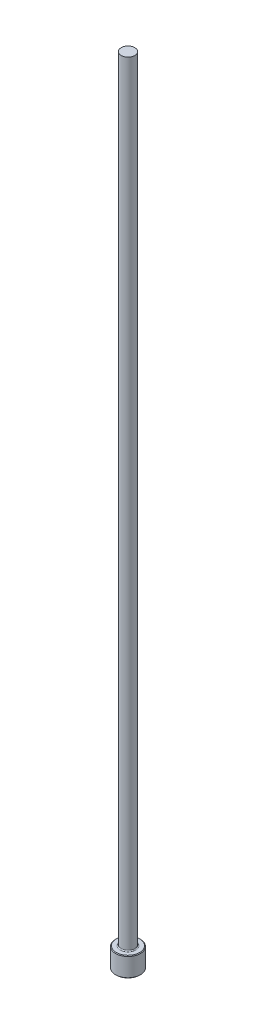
ISO-10303-21;
HEADER;
FILE_DESCRIPTION(('STEP AP214'),'2;1');
FILE_NAME('part.step','',(''),(''),'','','');
FILE_SCHEMA(('AUTOMOTIVE_DESIGN { 1 0 10303 214 1 1 1 1 }'));
ENDSEC;
DATA;
#1=APPLICATION_CONTEXT('core data for automotive mechanical design processes');
#2=APPLICATION_PROTOCOL_DEFINITION('international standard','automotive_design',2000,#1);
#3=PRODUCT_CONTEXT('',#1,'mechanical');
#4=PRODUCT('Part','Part','',(#3));
#5=PRODUCT_RELATED_PRODUCT_CATEGORY('part','',(#4));
#6=PRODUCT_DEFINITION_FORMATION('','',#4);
#7=PRODUCT_DEFINITION_CONTEXT('part definition',#1,'design');
#8=PRODUCT_DEFINITION('design','',#6,#7);
#9=PRODUCT_DEFINITION_SHAPE('','',#8);
#10=(LENGTH_UNIT() NAMED_UNIT(*) SI_UNIT(.MILLI.,.METRE.));
#11=(NAMED_UNIT(*) PLANE_ANGLE_UNIT() SI_UNIT($,.RADIAN.));
#12=(NAMED_UNIT(*) SI_UNIT($,.STERADIAN.) SOLID_ANGLE_UNIT());
#13=UNCERTAINTY_MEASURE_WITH_UNIT(LENGTH_MEASURE(1.E-05),#10,'distance_accuracy_value','');
#14=(GEOMETRIC_REPRESENTATION_CONTEXT(3) GLOBAL_UNCERTAINTY_ASSIGNED_CONTEXT((#13)) GLOBAL_UNIT_ASSIGNED_CONTEXT((#10,
#11,#12)) REPRESENTATION_CONTEXT('',''));
#15=CARTESIAN_POINT('',(0.,0.,0.));
#16=DIRECTION('',(0.,0.,1.));
#17=DIRECTION('',(1.,0.,0.));
#18=AXIS2_PLACEMENT_3D('',#15,#16,#17);
#19=CARTESIAN_POINT('',(0.,0.,0.));
#20=DIRECTION('',(0.,-1.,0.));
#21=DIRECTION('',(0.,0.,-1.));
#22=AXIS2_PLACEMENT_3D('',#19,#20,#21);
#23=PLANE('',#22);
#24=CARTESIAN_POINT('',(0.,0.,0.));
#25=DIRECTION('',(0.,-1.,0.));
#26=DIRECTION('',(0.,0.,-1.));
#27=AXIS2_PLACEMENT_3D('',#24,#25,#26);
#28=CIRCLE('',#27,0.939799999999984);
#29=CARTESIAN_POINT('',(0.,0.,0.939799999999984));
#30=VERTEX_POINT('',#29);
#31=EDGE_CURVE('E46',#30,#30,#28,.T.);
#32=ORIENTED_EDGE('',*,*,#31,.T.);
#33=EDGE_LOOP('',(#32));
#34=FACE_BOUND('',#33,.T.);
#35=ADVANCED_FACE('F35',(#34),#23,.T.);
#36=CARTESIAN_POINT('',(0.,259.958771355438,0.));
#37=DIRECTION('',(0.,1.,0.));
#38=DIRECTION('',(0.,0.,1.));
#39=AXIS2_PLACEMENT_3D('',#36,#37,#38);
#40=CYLINDRICAL_SURFACE('',#39,0.990599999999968);
#41=CARTESIAN_POINT('',(0.,1.52399999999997,0.));
#42=DIRECTION('',(0.,1.,0.));
#43=DIRECTION('',(0.,0.,1.));
#44=AXIS2_PLACEMENT_3D('',#41,#42,#43);
#45=CIRCLE('',#44,0.990599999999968);
#46=CARTESIAN_POINT('',(0.,1.52399999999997,0.990599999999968));
#47=VERTEX_POINT('',#46);
#48=EDGE_CURVE('E50',#47,#47,#45,.F.);
#49=ORIENTED_EDGE('',*,*,#48,.T.);
#50=EDGE_LOOP('',(#49));
#51=FACE_BOUND('',#50,.T.);
#52=CARTESIAN_POINT('',(0.,0.050799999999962,0.));
#53=DIRECTION('',(0.,-1.,0.));
#54=DIRECTION('',(0.,0.,-1.));
#55=AXIS2_PLACEMENT_3D('',#52,#53,#54);
#56=CIRCLE('',#55,0.990599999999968);
#57=CARTESIAN_POINT('',(0.,0.050799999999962,0.990599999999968));
#58=VERTEX_POINT('',#57);
#59=EDGE_CURVE('E55',#58,#58,#56,.F.);
#60=ORIENTED_EDGE('',*,*,#59,.T.);
#61=EDGE_LOOP('',(#60));
#62=FACE_BOUND('',#61,.T.);
#63=ADVANCED_FACE('F77',(#51,#62),#40,.T.);
#64=CARTESIAN_POINT('',(-0.990599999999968,1.5748,0.));
#65=DIRECTION('',(0.,1.,0.));
#66=DIRECTION('',(0.,0.,1.));
#67=AXIS2_PLACEMENT_3D('',#64,#65,#66);
#68=PLANE('',#67);
#69=CARTESIAN_POINT('',(0.,1.5748,0.));
#70=DIRECTION('',(0.,1.,0.));
#71=DIRECTION('',(0.,0.,1.));
#72=AXIS2_PLACEMENT_3D('',#69,#70,#71);
#73=CIRCLE('',#72,0.622299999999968);
#74=CARTESIAN_POINT('',(0.,1.5748,0.622299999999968));
#75=VERTEX_POINT('',#74);
#76=EDGE_CURVE('E10',#75,#75,#73,.F.);
#77=ORIENTED_EDGE('',*,*,#76,.T.);
#78=EDGE_LOOP('',(#77));
#79=FACE_BOUND('',#78,.T.);
#80=CARTESIAN_POINT('',(0.,1.5748,0.));
#81=DIRECTION('',(0.,1.,0.));
#82=DIRECTION('',(0.,0.,1.));
#83=AXIS2_PLACEMENT_3D('',#80,#81,#82);
#84=CIRCLE('',#83,0.939799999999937);
#85=CARTESIAN_POINT('',(0.,1.5748,0.939799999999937));
#86=VERTEX_POINT('',#85);
#87=EDGE_CURVE('E58',#86,#86,#84,.T.);
#88=ORIENTED_EDGE('',*,*,#87,.T.);
#89=EDGE_LOOP('',(#88));
#90=FACE_BOUND('',#89,.T.);
#91=ADVANCED_FACE('F69',(#79,#90),#68,.T.);
#92=CARTESIAN_POINT('',(0.,259.958771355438,0.));
#93=DIRECTION('',(0.,1.,0.));
#94=DIRECTION('',(0.,0.,1.));
#95=AXIS2_PLACEMENT_3D('',#92,#93,#94);
#96=CYLINDRICAL_SURFACE('',#95,0.546099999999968);
#97=CARTESIAN_POINT('',(0.,1.65100000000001,0.));
#98=DIRECTION('',(0.,1.,0.));
#99=DIRECTION('',(0.,0.,1.));
#100=AXIS2_PLACEMENT_3D('',#97,#98,#99);
#101=CIRCLE('',#100,0.546099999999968);
#102=CARTESIAN_POINT('',(0.,1.65100000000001,0.546099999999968));
#103=VERTEX_POINT('',#102);
#104=EDGE_CURVE('E42',#103,#103,#101,.T.);
#105=ORIENTED_EDGE('',*,*,#104,.T.);
#106=EDGE_LOOP('',(#105));
#107=FACE_BOUND('',#106,.T.);
#108=CARTESIAN_POINT('',(0.,63.5,0.));
#109=DIRECTION('',(0.,1.,0.));
#110=DIRECTION('',(0.,0.,1.));
#111=AXIS2_PLACEMENT_3D('',#108,#109,#110);
#112=CIRCLE('',#111,0.546099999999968);
#113=CARTESIAN_POINT('',(0.,63.5,0.546099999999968));
#114=VERTEX_POINT('',#113);
#115=EDGE_CURVE('E61',#114,#114,#112,.T.);
#116=ORIENTED_EDGE('',*,*,#115,.F.);
#117=EDGE_LOOP('',(#116));
#118=FACE_BOUND('',#117,.T.);
#119=ADVANCED_FACE('F67',(#107,#118),#96,.T.);
#120=CARTESIAN_POINT('',(-0.546099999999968,63.5,0.));
#121=DIRECTION('',(0.,1.,0.));
#122=DIRECTION('',(0.,0.,1.));
#123=AXIS2_PLACEMENT_3D('',#120,#121,#122);
#124=PLANE('',#123);
#125=ORIENTED_EDGE('',*,*,#115,.T.);
#126=EDGE_LOOP('',(#125));
#127=FACE_BOUND('',#126,.T.);
#128=ADVANCED_FACE('F65',(#127),#124,.T.);
#129=CARTESIAN_POINT('',(0.,1.57479999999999,0.));
#130=DIRECTION('',(0.,-1.,0.));
#131=DIRECTION('',(0.,0.,-1.));
#132=AXIS2_PLACEMENT_3D('',#129,#130,#131);
#133=CONICAL_SURFACE('',#132,0.939799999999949,0.785398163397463);
#134=ORIENTED_EDGE('',*,*,#48,.F.);
#135=EDGE_LOOP('',(#134));
#136=FACE_BOUND('',#135,.T.);
#137=ORIENTED_EDGE('',*,*,#87,.F.);
#138=EDGE_LOOP('',(#137));
#139=FACE_BOUND('',#138,.T.);
#140=ADVANCED_FACE('F75',(#136,#139),#133,.T.);
#141=CARTESIAN_POINT('',(0.,0.050799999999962,0.));
#142=DIRECTION('',(0.,1.,0.));
#143=DIRECTION('',(0.,0.,1.));
#144=AXIS2_PLACEMENT_3D('',#141,#142,#143);
#145=CONICAL_SURFACE('',#144,0.990599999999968,0.785398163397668);
#146=CARTESIAN_POINT('',(0.,0.,0.939799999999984));
#147=CARTESIAN_POINT('',(0.,0.000529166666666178,0.94032916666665));
#148=CARTESIAN_POINT('',(0.,0.00105833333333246,0.940858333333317));
#149=CARTESIAN_POINT('',(0.,0.00211666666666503,0.94191666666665));
#150=CARTESIAN_POINT('',(0.,0.00264583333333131,0.942445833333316));
#151=CARTESIAN_POINT('',(0.,0.00370416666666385,0.943504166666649));
#152=CARTESIAN_POINT('',(0.,0.0042333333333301,0.944033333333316));
#153=CARTESIAN_POINT('',(0.,0.00529166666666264,0.945091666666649));
#154=CARTESIAN_POINT('',(0.,0.00582083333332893,0.945620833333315));
#155=CARTESIAN_POINT('',(0.,0.00687916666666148,0.946679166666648));
#156=CARTESIAN_POINT('',(0.,0.00740833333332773,0.947208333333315));
#157=CARTESIAN_POINT('',(0.,0.00846666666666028,0.948266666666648));
#158=CARTESIAN_POINT('',(0.,0.00899583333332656,0.948795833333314));
#159=CARTESIAN_POINT('',(0.,0.0100541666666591,0.949854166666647));
#160=CARTESIAN_POINT('',(0.,0.0105833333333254,0.950383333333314));
#161=CARTESIAN_POINT('',(0.,0.0116416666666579,0.951441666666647));
#162=CARTESIAN_POINT('',(0.,0.0121708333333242,0.951970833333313));
#163=CARTESIAN_POINT('',(0.,0.0132291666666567,0.953029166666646));
#164=CARTESIAN_POINT('',(0.,0.013758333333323,0.953558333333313));
#165=CARTESIAN_POINT('',(0.,0.0148166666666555,0.954616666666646));
#166=CARTESIAN_POINT('',(0.,0.0153458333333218,0.955145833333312));
#167=CARTESIAN_POINT('',(0.,0.0164041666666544,0.956204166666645));
#168=CARTESIAN_POINT('',(0.,0.0169333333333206,0.956733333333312));
#169=CARTESIAN_POINT('',(0.,0.0179916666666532,0.957791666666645));
#170=CARTESIAN_POINT('',(0.,0.0185208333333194,0.958320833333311));
#171=CARTESIAN_POINT('',(0.,0.019579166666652,0.959379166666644));
#172=CARTESIAN_POINT('',(0.,0.0201083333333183,0.959908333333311));
#173=CARTESIAN_POINT('',(0.,0.0211666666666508,0.960966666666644));
#174=CARTESIAN_POINT('',(0.,0.0216958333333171,0.96149583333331));
#175=CARTESIAN_POINT('',(0.,0.0227541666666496,0.962554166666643));
#176=CARTESIAN_POINT('',(0.,0.0232833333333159,0.96308333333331));
#177=CARTESIAN_POINT('',(0.,0.0243416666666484,0.964141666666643));
#178=CARTESIAN_POINT('',(0.,0.0248708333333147,0.964670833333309));
#179=CARTESIAN_POINT('',(0.,0.0259291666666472,0.965729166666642));
#180=CARTESIAN_POINT('',(0.,0.0264583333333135,0.966258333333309));
#181=CARTESIAN_POINT('',(0.,0.0275166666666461,0.967316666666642));
#182=CARTESIAN_POINT('',(0.,0.0280458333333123,0.967845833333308));
#183=CARTESIAN_POINT('',(0.,0.0291041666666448,0.968904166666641));
#184=CARTESIAN_POINT('',(0.,0.0296333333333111,0.969433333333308));
#185=CARTESIAN_POINT('',(0.,0.0306916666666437,0.970491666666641));
#186=CARTESIAN_POINT('',(0.,0.03122083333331,0.971020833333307));
#187=CARTESIAN_POINT('',(0.,0.0322791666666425,0.97207916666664));
#188=CARTESIAN_POINT('',(0.,0.0328083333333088,0.972608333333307));
#189=CARTESIAN_POINT('',(0.,0.0338666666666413,0.97366666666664));
#190=CARTESIAN_POINT('',(0.,0.0343958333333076,0.974195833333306));
#191=CARTESIAN_POINT('',(0.,0.0354541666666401,0.975254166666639));
#192=CARTESIAN_POINT('',(0.,0.0359833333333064,0.975783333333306));
#193=CARTESIAN_POINT('',(0.,0.0370416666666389,0.976841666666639));
#194=CARTESIAN_POINT('',(0.,0.0375708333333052,0.977370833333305));
#195=CARTESIAN_POINT('',(0.,0.0386291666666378,0.978429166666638));
#196=CARTESIAN_POINT('',(0.,0.039158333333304,0.978958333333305));
#197=CARTESIAN_POINT('',(0.,0.0402166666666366,0.980016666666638));
#198=CARTESIAN_POINT('',(0.,0.0407458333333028,0.980545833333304));
#199=CARTESIAN_POINT('',(0.,0.0418041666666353,0.981604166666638));
#200=CARTESIAN_POINT('',(0.,0.0423333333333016,0.982133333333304));
#201=CARTESIAN_POINT('',(0.,0.0433916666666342,0.983191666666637));
#202=CARTESIAN_POINT('',(0.,0.0439208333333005,0.983720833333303));
#203=CARTESIAN_POINT('',(0.,0.044979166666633,0.984779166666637));
#204=CARTESIAN_POINT('',(0.,0.0455083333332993,0.985308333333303));
#205=CARTESIAN_POINT('',(0.,0.0465666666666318,0.986366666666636));
#206=CARTESIAN_POINT('',(0.,0.0470958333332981,0.986895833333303));
#207=CARTESIAN_POINT('',(0.,0.0481541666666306,0.987954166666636));
#208=CARTESIAN_POINT('',(0.,0.0486833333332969,0.988483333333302));
#209=CARTESIAN_POINT('',(0.,0.0497416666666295,0.989541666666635));
#210=CARTESIAN_POINT('',(0.,0.0502708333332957,0.990070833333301));
#211=CARTESIAN_POINT('',(0.,0.050799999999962,0.990599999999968));
#212=B_SPLINE_CURVE_WITH_KNOTS('',3,(#146,#147,#148,#149,#150,#151,#152,#153,#154,#155,#156,
#157,#158,#159,#160,#161,#162,#163,#164,#165,#166,#167,#168,#169,#170,#171,#172,#173,#174,#175,
#176,#177,#178,#179,#180,#181,#182,#183,#184,#185,#186,#187,#188,#189,#190,#191,#192,#193,#194,
#195,#196,#197,#198,#199,#200,#201,#202,#203,#204,#205,#206,#207,#208,#209,#210,#211),
.UNSPECIFIED.,.F.,.F.,(4,2,2,2,2,2,2,2,2,2,2,2,2,2,2,2,2,2,2,2,2,2,2,2,2,2,2,2,2,2,2,2,4),(0.,
0.00224506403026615,0.00449012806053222,0.00673519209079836,0.00898025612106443,
0.0112253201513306,0.0134703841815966,0.0157154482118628,0.0179605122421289,0.020205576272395,
0.0224506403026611,0.0246957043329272,0.0269407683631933,0.0291858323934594,0.0314308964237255,
0.0336759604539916,0.0359210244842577,0.0381660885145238,0.0404111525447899,0.042656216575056,
0.0449012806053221,0.0471463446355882,0.0493914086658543,0.0516364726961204,0.0538815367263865,
0.0561266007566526,0.0583716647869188,0.0606167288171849,0.0628617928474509,0.065106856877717,
0.0673519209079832,0.0695969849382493,0.0718420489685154),.UNSPECIFIED.);
#213=EDGE_CURVE('BSEAM89',#30,#58,#212,.T.);
#214=ORIENTED_EDGE('',*,*,#31,.F.);
#215=ORIENTED_EDGE('',*,*,#59,.F.);
#216=ORIENTED_EDGE('',*,*,#213,.T.);
#217=ORIENTED_EDGE('',*,*,#213,.F.);
#218=EDGE_LOOP('',(#214,#216,#215,#217));
#219=FACE_BOUND('',#218,.T.);
#220=ADVANCED_FACE('F89',(#219),#145,.T.);
#221=CARTESIAN_POINT('',(0.,1.65100000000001,0.));
#222=DIRECTION('',(0.,1.,0.));
#223=DIRECTION('',(0.,0.,1.));
#224=AXIS2_PLACEMENT_3D('',#221,#222,#223);
#225=TOROIDAL_SURFACE('',#224,0.622299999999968,0.0762);
#226=ORIENTED_EDGE('',*,*,#76,.F.);
#227=EDGE_LOOP('',(#226));
#228=FACE_BOUND('',#227,.T.);
#229=ORIENTED_EDGE('',*,*,#104,.F.);
#230=EDGE_LOOP('',(#229));
#231=FACE_BOUND('',#230,.T.);
#232=ADVANCED_FACE('F37',(#228,#231),#225,.F.);
#233=CLOSED_SHELL('',(#35,#63,#91,#119,#128,#140,#220,#232));
#234=MANIFOLD_SOLID_BREP('B2',#233);
#235=ADVANCED_BREP_SHAPE_REPRESENTATION('',(#18,#234),#14);
#236=SHAPE_DEFINITION_REPRESENTATION(#9,#235);
ENDSEC;
END-ISO-10303-21;
